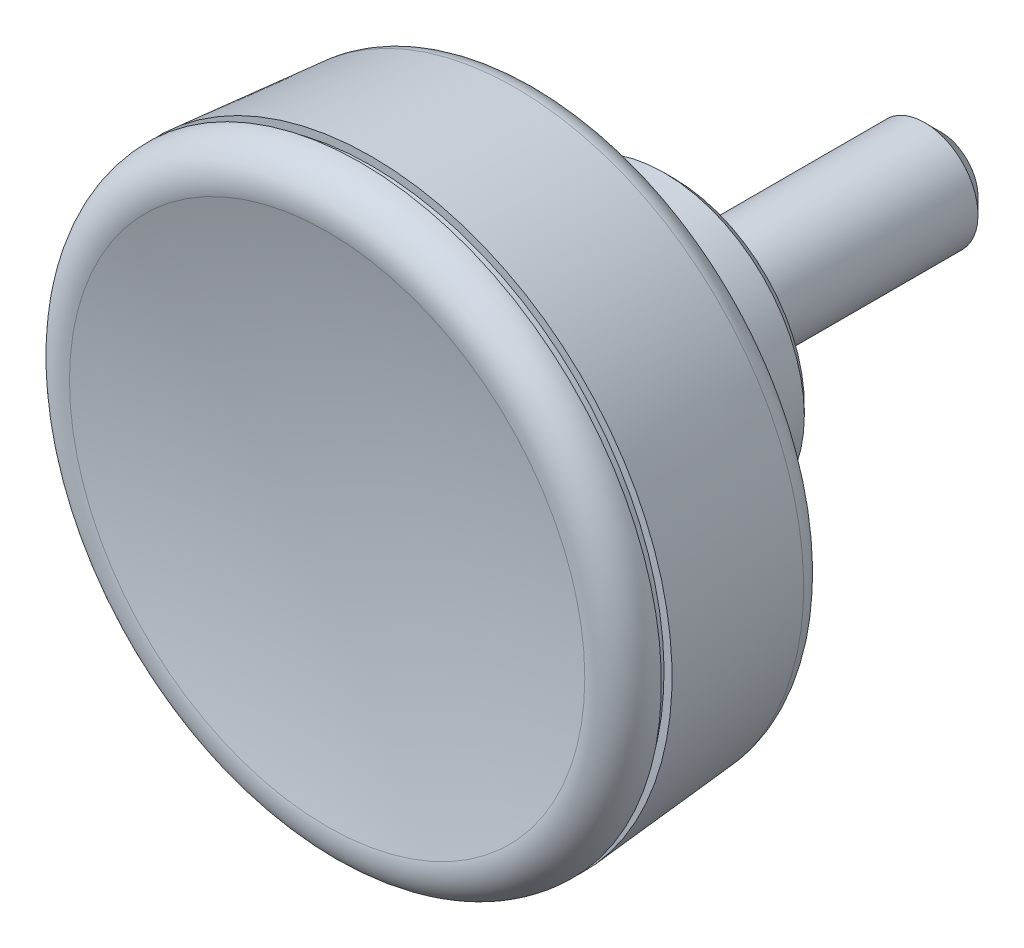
ISO-10303-21;
HEADER;
FILE_DESCRIPTION(('STEP AP214'),'2;1');
FILE_NAME('part.step','',(''),(''),'','','');
FILE_SCHEMA(('AUTOMOTIVE_DESIGN { 1 0 10303 214 1 1 1 1 }'));
ENDSEC;
DATA;
#1=APPLICATION_CONTEXT('core data for automotive mechanical design processes');
#2=APPLICATION_PROTOCOL_DEFINITION('international standard','automotive_design',2000,#1);
#3=PRODUCT_CONTEXT('',#1,'mechanical');
#4=PRODUCT('Part','Part','',(#3));
#5=PRODUCT_RELATED_PRODUCT_CATEGORY('part','',(#4));
#6=PRODUCT_DEFINITION_FORMATION('','',#4);
#7=PRODUCT_DEFINITION_CONTEXT('part definition',#1,'design');
#8=PRODUCT_DEFINITION('design','',#6,#7);
#9=PRODUCT_DEFINITION_SHAPE('','',#8);
#10=(LENGTH_UNIT() NAMED_UNIT(*) SI_UNIT(.MILLI.,.METRE.));
#11=(NAMED_UNIT(*) PLANE_ANGLE_UNIT() SI_UNIT($,.RADIAN.));
#12=(NAMED_UNIT(*) SI_UNIT($,.STERADIAN.) SOLID_ANGLE_UNIT());
#13=UNCERTAINTY_MEASURE_WITH_UNIT(LENGTH_MEASURE(1.E-05),#10,'distance_accuracy_value','');
#14=(GEOMETRIC_REPRESENTATION_CONTEXT(3) GLOBAL_UNCERTAINTY_ASSIGNED_CONTEXT((#13)) GLOBAL_UNIT_ASSIGNED_CONTEXT((#10,
#11,#12)) REPRESENTATION_CONTEXT('',''));
#15=CARTESIAN_POINT('',(0.,0.,0.));
#16=DIRECTION('',(0.,0.,1.));
#17=DIRECTION('',(1.,0.,0.));
#18=AXIS2_PLACEMENT_3D('',#15,#16,#17);
#19=CARTESIAN_POINT('',(0.,0.,-20.));
#20=DIRECTION('',(0.,0.,-1.));
#21=DIRECTION('',(0.,1.,0.));
#22=AXIS2_PLACEMENT_3D('',#19,#20,#21);
#23=CYLINDRICAL_SURFACE('',#22,4.);
#24=CARTESIAN_POINT('',(0.,0.,-18.8));
#25=DIRECTION('',(0.,0.,-1.));
#26=DIRECTION('',(-1.,0.,0.));
#27=AXIS2_PLACEMENT_3D('',#24,#25,#26);
#28=CIRCLE('',#27,4.);
#29=CARTESIAN_POINT('',(-4.,0.,-18.8));
#30=VERTEX_POINT('',#29);
#31=EDGE_CURVE('E8',#30,#30,#28,.F.);
#32=ORIENTED_EDGE('',*,*,#31,.T.);
#33=EDGE_LOOP('',(#32));
#34=FACE_BOUND('',#33,.T.);
#35=CARTESIAN_POINT('',(0.,0.,0.));
#36=DIRECTION('',(0.,0.,-1.));
#37=DIRECTION('',(0.,1.,0.));
#38=AXIS2_PLACEMENT_3D('',#35,#36,#37);
#39=CIRCLE('',#38,4.);
#40=CARTESIAN_POINT('',(0.,4.,0.));
#41=VERTEX_POINT('',#40);
#42=EDGE_CURVE('E23',#41,#41,#39,.T.);
#43=ORIENTED_EDGE('',*,*,#42,.T.);
#44=EDGE_LOOP('',(#43));
#45=FACE_BOUND('',#44,.T.);
#46=ADVANCED_FACE('F12',(#34,#45),#23,.T.);
#47=CARTESIAN_POINT('',(9.79676461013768,0.,0.));
#48=DIRECTION('',(0.,0.,-1.));
#49=DIRECTION('',(0.,1.,0.));
#50=AXIS2_PLACEMENT_3D('',#47,#48,#49);
#51=PLANE('',#50);
#52=CARTESIAN_POINT('',(0.,0.,0.));
#53=DIRECTION('',(0.,0.,-1.));
#54=DIRECTION('',(0.,1.,0.));
#55=AXIS2_PLACEMENT_3D('',#52,#53,#54);
#56=CIRCLE('',#55,9.79676461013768);
#57=CARTESIAN_POINT('',(0.,9.79676461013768,0.));
#58=VERTEX_POINT('',#57);
#59=EDGE_CURVE('E27',#58,#58,#56,.T.);
#60=ORIENTED_EDGE('',*,*,#59,.T.);
#61=EDGE_LOOP('',(#60));
#62=FACE_BOUND('',#61,.T.);
#63=ORIENTED_EDGE('',*,*,#42,.F.);
#64=EDGE_LOOP('',(#63));
#65=FACE_BOUND('',#64,.T.);
#66=ADVANCED_FACE('F79',(#62,#65),#51,.T.);
#67=CARTESIAN_POINT('',(0.,0.,0.));
#68=DIRECTION('',(0.,0.,1.));
#69=DIRECTION('',(0.,-1.,0.));
#70=AXIS2_PLACEMENT_3D('',#67,#68,#69);
#71=CONICAL_SURFACE('',#70,9.79676461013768,0.785398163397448);
#72=CARTESIAN_POINT('',(0.,0.,0.7));
#73=DIRECTION('',(0.,0.,-1.));
#74=DIRECTION('',(0.,1.,0.));
#75=AXIS2_PLACEMENT_3D('',#72,#73,#74);
#76=CIRCLE('',#75,10.4967646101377);
#77=CARTESIAN_POINT('',(0.,10.4967646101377,0.7));
#78=VERTEX_POINT('',#77);
#79=EDGE_CURVE('E32',#78,#78,#76,.T.);
#80=ORIENTED_EDGE('',*,*,#79,.T.);
#81=EDGE_LOOP('',(#80));
#82=FACE_BOUND('',#81,.T.);
#83=ORIENTED_EDGE('',*,*,#59,.F.);
#84=EDGE_LOOP('',(#83));
#85=FACE_BOUND('',#84,.T.);
#86=ADVANCED_FACE('F85',(#82,#85),#71,.T.);
#87=CARTESIAN_POINT('',(0.,0.,-20.));
#88=DIRECTION('',(0.,0.,-1.));
#89=DIRECTION('',(0.,1.,0.));
#90=AXIS2_PLACEMENT_3D('',#87,#88,#89);
#91=CYLINDRICAL_SURFACE('',#90,10.4967646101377);
#92=CARTESIAN_POINT('',(0.,0.,9.06177687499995));
#93=DIRECTION('',(0.,0.,-1.));
#94=DIRECTION('',(0.,1.,0.));
#95=AXIS2_PLACEMENT_3D('',#92,#93,#94);
#96=CIRCLE('',#95,10.4967646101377);
#97=CARTESIAN_POINT('',(0.,10.4967646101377,9.06177687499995));
#98=VERTEX_POINT('',#97);
#99=EDGE_CURVE('E35',#98,#98,#96,.T.);
#100=ORIENTED_EDGE('',*,*,#99,.T.);
#101=EDGE_LOOP('',(#100));
#102=FACE_BOUND('',#101,.T.);
#103=ORIENTED_EDGE('',*,*,#79,.F.);
#104=EDGE_LOOP('',(#103));
#105=FACE_BOUND('',#104,.T.);
#106=ADVANCED_FACE('F92',(#102,#105),#91,.T.);
#107=CARTESIAN_POINT('',(0.,0.,9.06177687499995));
#108=DIRECTION('',(0.,0.,-1.));
#109=DIRECTION('',(0.,1.,0.));
#110=AXIS2_PLACEMENT_3D('',#107,#108,#109);
#111=TOROIDAL_SURFACE('',#110,11.4342646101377,0.937500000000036);
#112=CARTESIAN_POINT('',(0.,0.,9.999276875));
#113=DIRECTION('',(0.,0.,-1.));
#114=DIRECTION('',(0.,1.,0.));
#115=AXIS2_PLACEMENT_3D('',#112,#113,#114);
#116=CIRCLE('',#115,11.4342646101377);
#117=CARTESIAN_POINT('',(0.,11.4342646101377,9.999276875));
#118=VERTEX_POINT('',#117);
#119=EDGE_CURVE('E38',#118,#118,#116,.T.);
#120=ORIENTED_EDGE('',*,*,#119,.T.);
#121=EDGE_LOOP('',(#120));
#122=FACE_BOUND('',#121,.T.);
#123=ORIENTED_EDGE('',*,*,#99,.F.);
#124=EDGE_LOOP('',(#123));
#125=FACE_BOUND('',#124,.T.);
#126=ADVANCED_FACE('F96',(#122,#125),#111,.F.);
#127=CARTESIAN_POINT('',(11.4342646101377,0.,9.999276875));
#128=DIRECTION('',(0.,0.,-1.));
#129=DIRECTION('',(0.,1.,0.));
#130=AXIS2_PLACEMENT_3D('',#127,#128,#129);
#131=PLANE('',#130);
#132=CARTESIAN_POINT('',(0.,0.,9.999276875));
#133=DIRECTION('',(0.,0.,-1.));
#134=DIRECTION('',(0.,1.,0.));
#135=AXIS2_PLACEMENT_3D('',#132,#133,#134);
#136=CIRCLE('',#135,19.5827925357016);
#137=CARTESIAN_POINT('',(0.,19.5827925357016,9.999276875));
#138=VERTEX_POINT('',#137);
#139=EDGE_CURVE('E41',#138,#138,#136,.T.);
#140=ORIENTED_EDGE('',*,*,#139,.T.);
#141=EDGE_LOOP('',(#140));
#142=FACE_BOUND('',#141,.T.);
#143=ORIENTED_EDGE('',*,*,#119,.F.);
#144=EDGE_LOOP('',(#143));
#145=FACE_BOUND('',#144,.T.);
#146=ADVANCED_FACE('F100',(#142,#145),#131,.T.);
#147=CARTESIAN_POINT('',(0.,0.,12.0082034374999));
#148=DIRECTION('',(0.,0.,-1.));
#149=DIRECTION('',(0.,1.,0.));
#150=AXIS2_PLACEMENT_3D('',#147,#148,#149);
#151=TOROIDAL_SURFACE('',#150,19.5827925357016,2.00892656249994);
#152=CARTESIAN_POINT('',(0.,0.,11.8381158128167));
#153=DIRECTION('',(0.,0.,-1.));
#154=DIRECTION('',(0.,1.,0.));
#155=AXIS2_PLACEMENT_3D('',#152,#153,#154);
#156=CIRCLE('',#155,21.5845058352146);
#157=CARTESIAN_POINT('',(0.,21.5845058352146,11.8381158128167));
#158=VERTEX_POINT('',#157);
#159=EDGE_CURVE('E44',#158,#158,#156,.T.);
#160=ORIENTED_EDGE('',*,*,#159,.T.);
#161=EDGE_LOOP('',(#160));
#162=FACE_BOUND('',#161,.T.);
#163=ORIENTED_EDGE('',*,*,#139,.F.);
#164=EDGE_LOOP('',(#163));
#165=FACE_BOUND('',#164,.T.);
#166=ADVANCED_FACE('F104',(#162,#165),#151,.T.);
#167=CARTESIAN_POINT('',(0.,0.,11.8381158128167));
#168=DIRECTION('',(0.,0.,1.));
#169=DIRECTION('',(0.,-1.,0.));
#170=AXIS2_PLACEMENT_3D('',#167,#168,#169);
#171=CONICAL_SURFACE('',#170,21.5845058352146,0.0847674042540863);
#172=CARTESIAN_POINT('',(0.,0.,22.6056900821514));
#173=DIRECTION('',(0.,0.,-1.));
#174=DIRECTION('',(0.,1.,0.));
#175=AXIS2_PLACEMENT_3D('',#172,#173,#174);
#176=CIRCLE('',#175,22.4994376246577);
#177=CARTESIAN_POINT('',(0.,22.4994376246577,22.6056900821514));
#178=VERTEX_POINT('',#177);
#179=EDGE_CURVE('E47',#178,#178,#176,.T.);
#180=ORIENTED_EDGE('',*,*,#179,.T.);
#181=EDGE_LOOP('',(#180));
#182=FACE_BOUND('',#181,.T.);
#183=ORIENTED_EDGE('',*,*,#159,.F.);
#184=EDGE_LOOP('',(#183));
#185=FACE_BOUND('',#184,.T.);
#186=ADVANCED_FACE('F108',(#182,#185),#171,.T.);
#187=CARTESIAN_POINT('',(21.9,0.,22.6056900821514));
#188=DIRECTION('',(0.,0.,1.));
#189=DIRECTION('',(0.,-1.,0.));
#190=AXIS2_PLACEMENT_3D('',#187,#188,#189);
#191=PLANE('',#190);
#192=CARTESIAN_POINT('',(0.,0.,22.6056900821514));
#193=DIRECTION('',(0.,0.,-1.));
#194=DIRECTION('',(0.,1.,0.));
#195=AXIS2_PLACEMENT_3D('',#192,#193,#194);
#196=CIRCLE('',#195,21.9);
#197=CARTESIAN_POINT('',(0.,21.9,22.6056900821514));
#198=VERTEX_POINT('',#197);
#199=EDGE_CURVE('E50',#198,#198,#196,.T.);
#200=ORIENTED_EDGE('',*,*,#199,.T.);
#201=EDGE_LOOP('',(#200));
#202=FACE_BOUND('',#201,.T.);
#203=ORIENTED_EDGE('',*,*,#179,.F.);
#204=EDGE_LOOP('',(#203));
#205=FACE_BOUND('',#204,.T.);
#206=ADVANCED_FACE('F112',(#202,#205),#191,.T.);
#207=CARTESIAN_POINT('',(0.,0.,-20.));
#208=DIRECTION('',(0.,0.,-1.));
#209=DIRECTION('',(0.,1.,0.));
#210=AXIS2_PLACEMENT_3D('',#207,#208,#209);
#211=CYLINDRICAL_SURFACE('',#210,21.9);
#212=CARTESIAN_POINT('',(0.,0.,23.4028322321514));
#213=DIRECTION('',(0.,0.,-1.));
#214=DIRECTION('',(0.,1.,0.));
#215=AXIS2_PLACEMENT_3D('',#212,#213,#214);
#216=CIRCLE('',#215,21.9);
#217=CARTESIAN_POINT('',(0.,21.9,23.4028322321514));
#218=VERTEX_POINT('',#217);
#219=EDGE_CURVE('E53',#218,#218,#216,.T.);
#220=ORIENTED_EDGE('',*,*,#219,.T.);
#221=EDGE_LOOP('',(#220));
#222=FACE_BOUND('',#221,.T.);
#223=ORIENTED_EDGE('',*,*,#199,.F.);
#224=EDGE_LOOP('',(#223));
#225=FACE_BOUND('',#224,.T.);
#226=ADVANCED_FACE('F116',(#222,#225),#211,.T.);
#227=CARTESIAN_POINT('',(21.9,0.,23.4028322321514));
#228=DIRECTION('',(0.,0.,-1.));
#229=DIRECTION('',(0.,1.,0.));
#230=AXIS2_PLACEMENT_3D('',#227,#228,#229);
#231=PLANE('',#230);
#232=CARTESIAN_POINT('',(0.,0.,23.4028322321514));
#233=DIRECTION('',(0.,0.,-1.));
#234=DIRECTION('',(0.,1.,0.));
#235=AXIS2_PLACEMENT_3D('',#232,#233,#234);
#236=CIRCLE('',#235,22.4999775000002);
#237=CARTESIAN_POINT('',(0.,22.4999775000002,23.4028322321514));
#238=VERTEX_POINT('',#237);
#239=EDGE_CURVE('E56',#238,#238,#236,.T.);
#240=ORIENTED_EDGE('',*,*,#239,.T.);
#241=EDGE_LOOP('',(#240));
#242=FACE_BOUND('',#241,.T.);
#243=ORIENTED_EDGE('',*,*,#219,.F.);
#244=EDGE_LOOP('',(#243));
#245=FACE_BOUND('',#244,.T.);
#246=ADVANCED_FACE('F76',(#242,#245),#231,.T.);
#247=CARTESIAN_POINT('',(0.,0.,23.402832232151));
#248=DIRECTION('',(0.,0.,-1.));
#249=DIRECTION('',(0.,1.,0.));
#250=AXIS2_PLACEMENT_3D('',#247,#248,#249);
#251=TOROIDAL_SURFACE('',#250,19.8999775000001,2.60000000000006);
#252=CARTESIAN_POINT('',(0.,0.,25.9307460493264));
#253=DIRECTION('',(0.,0.,-1.));
#254=DIRECTION('',(0.,1.,0.));
#255=AXIS2_PLACEMENT_3D('',#252,#253,#254);
#256=CIRCLE('',#255,19.2919875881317);
#257=CARTESIAN_POINT('',(0.,19.2919875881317,25.9307460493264));
#258=VERTEX_POINT('',#257);
#259=EDGE_CURVE('E59',#258,#258,#256,.T.);
#260=ORIENTED_EDGE('',*,*,#259,.T.);
#261=EDGE_LOOP('',(#260));
#262=FACE_BOUND('',#261,.T.);
#263=ORIENTED_EDGE('',*,*,#239,.F.);
#264=EDGE_LOOP('',(#263));
#265=FACE_BOUND('',#264,.T.);
#266=ADVANCED_FACE('F63',(#262,#265),#251,.T.);
#267=CARTESIAN_POINT('',(0.,0.,106.143396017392));
#268=DIRECTION('',(0.,0.,-1.));
#269=DIRECTION('',(1.,0.,0.));
#270=AXIS2_PLACEMENT_3D('',#267,#268,#269);
#271=SPHERICAL_SURFACE('',#270,82.5);
#272=ORIENTED_EDGE('',*,*,#259,.F.);
#273=EDGE_LOOP('',(#272));
#274=FACE_BOUND('',#273,.T.);
#275=ADVANCED_FACE('F66',(#274),#271,.F.);
#276=CARTESIAN_POINT('',(2.74999999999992,0.,-20.));
#277=DIRECTION('',(0.,0.,-1.));
#278=DIRECTION('',(0.,1.,0.));
#279=AXIS2_PLACEMENT_3D('',#276,#277,#278);
#280=PLANE('',#279);
#281=CARTESIAN_POINT('',(0.,0.,-20.));
#282=DIRECTION('',(0.,0.,-1.));
#283=DIRECTION('',(-1.,0.,0.));
#284=AXIS2_PLACEMENT_3D('',#281,#282,#283);
#285=CIRCLE('',#284,2.8);
#286=CARTESIAN_POINT('',(-2.8,0.,-20.));
#287=VERTEX_POINT('',#286);
#288=EDGE_CURVE('E19',#287,#287,#285,.T.);
#289=ORIENTED_EDGE('',*,*,#288,.T.);
#290=EDGE_LOOP('',(#289));
#291=FACE_BOUND('',#290,.T.);
#292=ADVANCED_FACE('F68',(#291),#280,.T.);
#293=CARTESIAN_POINT('',(0.,0.,-20.));
#294=DIRECTION('',(0.,0.,1.));
#295=DIRECTION('',(1.,0.,0.));
#296=AXIS2_PLACEMENT_3D('',#293,#294,#295);
#297=CONICAL_SURFACE('',#296,2.8,0.785398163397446);
#298=ORIENTED_EDGE('',*,*,#31,.F.);
#299=EDGE_LOOP('',(#298));
#300=FACE_BOUND('',#299,.T.);
#301=ORIENTED_EDGE('',*,*,#288,.F.);
#302=EDGE_LOOP('',(#301));
#303=FACE_BOUND('',#302,.T.);
#304=ADVANCED_FACE('F14',(#300,#303),#297,.T.);
#305=CLOSED_SHELL('',(#46,#66,#86,#106,#126,#146,#166,#186,#206,#226,#246,#266,#275,#292,#304));
#306=MANIFOLD_SOLID_BREP('B1',#305);
#307=ADVANCED_BREP_SHAPE_REPRESENTATION('',(#18,#306),#14);
#308=SHAPE_DEFINITION_REPRESENTATION(#9,#307);
ENDSEC;
END-ISO-10303-21;
